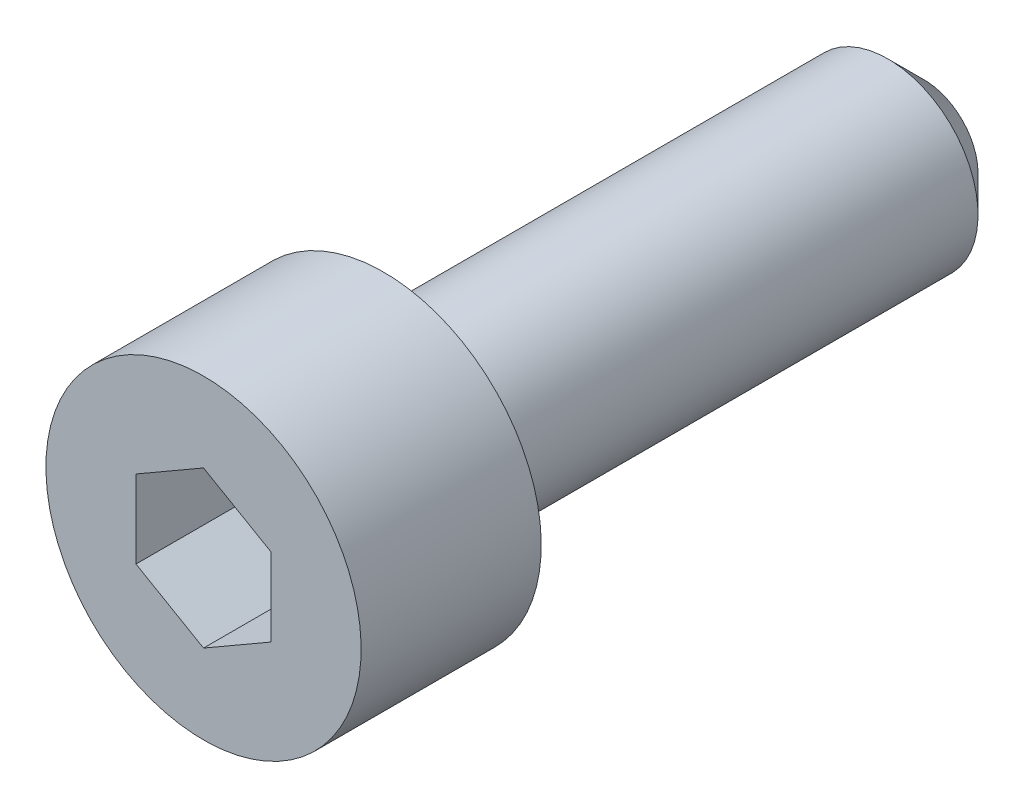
ISO-10303-21;
HEADER;
FILE_DESCRIPTION(('STEP AP214'),'2;1');
FILE_NAME('part.step','',(''),(''),'','','');
FILE_SCHEMA(('AUTOMOTIVE_DESIGN { 1 0 10303 214 1 1 1 1 }'));
ENDSEC;
DATA;
#1=APPLICATION_CONTEXT('core data for automotive mechanical design processes');
#2=APPLICATION_PROTOCOL_DEFINITION('international standard','automotive_design',2000,#1);
#3=PRODUCT_CONTEXT('',#1,'mechanical');
#4=PRODUCT('Part','Part','',(#3));
#5=PRODUCT_RELATED_PRODUCT_CATEGORY('part','',(#4));
#6=PRODUCT_DEFINITION_FORMATION('','',#4);
#7=PRODUCT_DEFINITION_CONTEXT('part definition',#1,'design');
#8=PRODUCT_DEFINITION('design','',#6,#7);
#9=PRODUCT_DEFINITION_SHAPE('','',#8);
#10=(LENGTH_UNIT() NAMED_UNIT(*) SI_UNIT(.MILLI.,.METRE.));
#11=(NAMED_UNIT(*) PLANE_ANGLE_UNIT() SI_UNIT($,.RADIAN.));
#12=(NAMED_UNIT(*) SI_UNIT($,.STERADIAN.) SOLID_ANGLE_UNIT());
#13=UNCERTAINTY_MEASURE_WITH_UNIT(LENGTH_MEASURE(1.E-05),#10,'distance_accuracy_value','');
#14=(GEOMETRIC_REPRESENTATION_CONTEXT(3) GLOBAL_UNCERTAINTY_ASSIGNED_CONTEXT((#13)) GLOBAL_UNIT_ASSIGNED_CONTEXT((#10,
#11,#12)) REPRESENTATION_CONTEXT('',''));
#15=CARTESIAN_POINT('',(0.,0.,0.));
#16=DIRECTION('',(0.,0.,1.));
#17=DIRECTION('',(1.,0.,0.));
#18=AXIS2_PLACEMENT_3D('',#15,#16,#17);
#19=CARTESIAN_POINT('',(0.,0.,0.));
#20=DIRECTION('',(0.,0.,-1.));
#21=DIRECTION('',(-0.866025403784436,0.5,0.));
#22=AXIS2_PLACEMENT_3D('',#19,#20,#21);
#23=CYLINDRICAL_SURFACE('',#22,2.);
#24=CARTESIAN_POINT('',(0.,0.,-11.2));
#25=DIRECTION('',(0.,0.,-1.));
#26=DIRECTION('',(-0.866025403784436,0.5,0.));
#27=AXIS2_PLACEMENT_3D('',#24,#25,#26);
#28=CIRCLE('',#27,2.);
#29=CARTESIAN_POINT('',(-1.73205080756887,1.,-11.2));
#30=VERTEX_POINT('',#29);
#31=EDGE_CURVE('E9',#30,#30,#28,.F.);
#32=ORIENTED_EDGE('',*,*,#31,.T.);
#33=EDGE_LOOP('',(#32));
#34=FACE_BOUND('',#33,.T.);
#35=CARTESIAN_POINT('',(0.,0.,0.));
#36=DIRECTION('',(0.,0.,-1.));
#37=DIRECTION('',(-0.866025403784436,0.5,0.));
#38=AXIS2_PLACEMENT_3D('',#35,#36,#37);
#39=CIRCLE('',#38,2.);
#40=CARTESIAN_POINT('',(-1.73205080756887,1.,0.));
#41=VERTEX_POINT('',#40);
#42=EDGE_CURVE('E129',#41,#41,#39,.T.);
#43=ORIENTED_EDGE('',*,*,#42,.T.);
#44=EDGE_LOOP('',(#43));
#45=FACE_BOUND('',#44,.T.);
#46=ADVANCED_FACE('F14',(#34,#45),#23,.T.);
#47=CARTESIAN_POINT('',(1.75,3.03108891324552,0.));
#48=DIRECTION('',(0.,0.,1.));
#49=DIRECTION('',(0.866025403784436,-0.5,0.));
#50=AXIS2_PLACEMENT_3D('',#47,#48,#49);
#51=PLANE('',#50);
#52=ORIENTED_EDGE('',*,*,#42,.F.);
#53=EDGE_LOOP('',(#52));
#54=FACE_BOUND('',#53,.T.);
#55=CARTESIAN_POINT('',(0.,0.,0.));
#56=DIRECTION('',(0.,0.,-1.));
#57=DIRECTION('',(-0.866025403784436,0.5,0.));
#58=AXIS2_PLACEMENT_3D('',#55,#56,#57);
#59=CIRCLE('',#58,3.5);
#60=CARTESIAN_POINT('',(-3.03108891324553,1.75,0.));
#61=VERTEX_POINT('',#60);
#62=EDGE_CURVE('E126',#61,#61,#59,.T.);
#63=ORIENTED_EDGE('',*,*,#62,.T.);
#64=EDGE_LOOP('',(#63));
#65=FACE_BOUND('',#64,.T.);
#66=ADVANCED_FACE('F148',(#54,#65),#51,.F.);
#67=CARTESIAN_POINT('',(0.,0.,0.));
#68=DIRECTION('',(0.,0.,-1.));
#69=DIRECTION('',(-0.866025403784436,0.5,0.));
#70=AXIS2_PLACEMENT_3D('',#67,#68,#69);
#71=CYLINDRICAL_SURFACE('',#70,3.5);
#72=ORIENTED_EDGE('',*,*,#62,.F.);
#73=EDGE_LOOP('',(#72));
#74=FACE_BOUND('',#73,.T.);
#75=CARTESIAN_POINT('',(0.,0.,4.));
#76=DIRECTION('',(0.,0.,-1.));
#77=DIRECTION('',(-0.866025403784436,0.5,0.));
#78=AXIS2_PLACEMENT_3D('',#75,#76,#77);
#79=CIRCLE('',#78,3.5);
#80=CARTESIAN_POINT('',(-3.03108891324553,1.75,4.));
#81=VERTEX_POINT('',#80);
#82=EDGE_CURVE('E117',#81,#81,#79,.T.);
#83=ORIENTED_EDGE('',*,*,#82,.T.);
#84=EDGE_LOOP('',(#83));
#85=FACE_BOUND('',#84,.T.);
#86=ADVANCED_FACE('F154',(#74,#85),#71,.T.);
#87=CARTESIAN_POINT('',(0.,0.,4.));
#88=DIRECTION('',(0.,0.,-1.));
#89=DIRECTION('',(-0.866025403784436,0.5,0.));
#90=AXIS2_PLACEMENT_3D('',#87,#88,#89);
#91=PLANE('',#90);
#92=DIRECTION('',(0.,1.,0.));
#93=VECTOR('',#92,1.);
#94=CARTESIAN_POINT('',(1.5,0.866025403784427,4.));
#95=LINE('',#94,#93);
#96=CARTESIAN_POINT('',(1.5,-0.866025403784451,4.));
#97=VERTEX_POINT('',#96);
#98=CARTESIAN_POINT('',(1.5,0.866025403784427,4.));
#99=VERTEX_POINT('',#98);
#100=EDGE_CURVE('E83',#97,#99,#95,.T.);
#101=ORIENTED_EDGE('',*,*,#100,.F.);
#102=DIRECTION('',(0.866025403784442,0.5,0.));
#103=VECTOR('',#102,1.);
#104=CARTESIAN_POINT('',(0.,-1.73205080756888,4.));
#105=LINE('',#104,#103);
#106=CARTESIAN_POINT('',(0.,-1.73205080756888,4.));
#107=VERTEX_POINT('',#106);
#108=EDGE_CURVE('E29',#107,#97,#105,.T.);
#109=ORIENTED_EDGE('',*,*,#108,.F.);
#110=DIRECTION('',(0.866025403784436,-0.5,0.));
#111=VECTOR('',#110,1.);
#112=CARTESIAN_POINT('',(-1.5,-0.866025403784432,4.));
#113=LINE('',#112,#111);
#114=CARTESIAN_POINT('',(-1.5,-0.866025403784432,4.));
#115=VERTEX_POINT('',#114);
#116=EDGE_CURVE('E99',#115,#107,#113,.T.);
#117=ORIENTED_EDGE('',*,*,#116,.F.);
#118=DIRECTION('',(0.,-1.,0.));
#119=VECTOR('',#118,1.);
#120=CARTESIAN_POINT('',(-1.5,-0.866025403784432,4.));
#121=LINE('',#120,#119);
#122=CARTESIAN_POINT('',(-1.5,0.86602540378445,4.));
#123=VERTEX_POINT('',#122);
#124=EDGE_CURVE('E93',#123,#115,#121,.T.);
#125=ORIENTED_EDGE('',*,*,#124,.F.);
#126=DIRECTION('',(-0.86602540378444,-0.499999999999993,0.));
#127=VECTOR('',#126,1.);
#128=CARTESIAN_POINT('',(0.,1.73205080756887,4.));
#129=LINE('',#128,#127);
#130=CARTESIAN_POINT('',(0.,1.73205080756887,4.));
#131=VERTEX_POINT('',#130);
#132=EDGE_CURVE('E91',#131,#123,#129,.T.);
#133=ORIENTED_EDGE('',*,*,#132,.F.);
#134=DIRECTION('',(-0.866025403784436,0.5,0.));
#135=VECTOR('',#134,1.);
#136=CARTESIAN_POINT('',(0.,1.73205080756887,4.));
#137=LINE('',#136,#135);
#138=EDGE_CURVE('E72',#99,#131,#137,.T.);
#139=ORIENTED_EDGE('',*,*,#138,.F.);
#140=EDGE_LOOP('',(#101,#109,#117,#125,#133,#139));
#141=FACE_BOUND('',#140,.T.);
#142=ORIENTED_EDGE('',*,*,#82,.F.);
#143=EDGE_LOOP('',(#142));
#144=FACE_BOUND('',#143,.T.);
#145=ADVANCED_FACE('F87',(#141,#144),#91,.F.);
#146=CARTESIAN_POINT('',(0.,0.,-12.));
#147=DIRECTION('',(0.,0.,-1.));
#148=DIRECTION('',(-0.866025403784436,0.5,0.));
#149=AXIS2_PLACEMENT_3D('',#146,#147,#148);
#150=PLANE('',#149);
#151=CARTESIAN_POINT('',(0.,0.,-12.));
#152=DIRECTION('',(0.,0.,-1.));
#153=DIRECTION('',(-0.866025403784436,0.5,0.));
#154=AXIS2_PLACEMENT_3D('',#151,#152,#153);
#155=CIRCLE('',#154,1.2);
#156=CARTESIAN_POINT('',(-1.03923048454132,0.6,-12.));
#157=VERTEX_POINT('',#156);
#158=EDGE_CURVE('E22',#157,#157,#155,.T.);
#159=ORIENTED_EDGE('',*,*,#158,.T.);
#160=EDGE_LOOP('',(#159));
#161=FACE_BOUND('',#160,.T.);
#162=ADVANCED_FACE('F134',(#161),#150,.T.);
#163=CARTESIAN_POINT('',(0.,-1.73205080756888,1.8));
#164=DIRECTION('',(0.5,-0.866025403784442,0.));
#165=DIRECTION('',(0.866025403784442,0.5,0.));
#166=AXIS2_PLACEMENT_3D('',#163,#164,#165);
#167=PLANE('',#166);
#168=ORIENTED_EDGE('',*,*,#108,.T.);
#169=DIRECTION('',(0.,0.,1.));
#170=VECTOR('',#169,1.);
#171=CARTESIAN_POINT('',(1.5,-0.86602540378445,1.8));
#172=LINE('',#171,#170);
#173=CARTESIAN_POINT('',(1.5,-0.86602540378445,1.8));
#174=VERTEX_POINT('',#173);
#175=EDGE_CURVE('E80',#174,#97,#172,.T.);
#176=ORIENTED_EDGE('',*,*,#175,.F.);
#177=DIRECTION('',(0.866025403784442,0.5,0.));
#178=VECTOR('',#177,1.);
#179=CARTESIAN_POINT('',(0.,-1.73205080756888,1.8));
#180=LINE('',#179,#178);
#181=CARTESIAN_POINT('',(0.,-1.73205080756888,1.8));
#182=VERTEX_POINT('',#181);
#183=EDGE_CURVE('E101',#182,#174,#180,.T.);
#184=ORIENTED_EDGE('',*,*,#183,.F.);
#185=DIRECTION('',(0.,0.,1.));
#186=VECTOR('',#185,1.);
#187=CARTESIAN_POINT('',(0.,-1.73205080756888,1.8));
#188=LINE('',#187,#186);
#189=EDGE_CURVE('E36',#182,#107,#188,.T.);
#190=ORIENTED_EDGE('',*,*,#189,.T.);
#191=EDGE_LOOP('',(#168,#176,#184,#190));
#192=FACE_BOUND('',#191,.T.);
#193=ADVANCED_FACE('F166',(#192),#167,.F.);
#194=CARTESIAN_POINT('',(-1.5,-0.866025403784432,1.8));
#195=DIRECTION('',(-0.5,-0.866025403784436,0.));
#196=DIRECTION('',(0.,0.,-1.));
#197=AXIS2_PLACEMENT_3D('',#194,#195,#196);
#198=PLANE('',#197);
#199=ORIENTED_EDGE('',*,*,#116,.T.);
#200=ORIENTED_EDGE('',*,*,#189,.F.);
#201=DIRECTION('',(0.866025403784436,-0.5,0.));
#202=VECTOR('',#201,1.);
#203=CARTESIAN_POINT('',(-1.5,-0.866025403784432,1.8));
#204=LINE('',#203,#202);
#205=CARTESIAN_POINT('',(-1.5,-0.866025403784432,1.8));
#206=VERTEX_POINT('',#205);
#207=EDGE_CURVE('E113',#206,#182,#204,.T.);
#208=ORIENTED_EDGE('',*,*,#207,.F.);
#209=DIRECTION('',(0.,0.,1.));
#210=VECTOR('',#209,1.);
#211=CARTESIAN_POINT('',(-1.5,-0.866025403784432,1.8));
#212=LINE('',#211,#210);
#213=EDGE_CURVE('E118',#206,#115,#212,.T.);
#214=ORIENTED_EDGE('',*,*,#213,.T.);
#215=EDGE_LOOP('',(#199,#200,#208,#214));
#216=FACE_BOUND('',#215,.T.);
#217=ADVANCED_FACE('F169',(#216),#198,.F.);
#218=CARTESIAN_POINT('',(-1.5,-0.866025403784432,1.8));
#219=DIRECTION('',(-1.,0.,0.));
#220=DIRECTION('',(0.,-1.,0.));
#221=AXIS2_PLACEMENT_3D('',#218,#219,#220);
#222=PLANE('',#221);
#223=ORIENTED_EDGE('',*,*,#124,.T.);
#224=ORIENTED_EDGE('',*,*,#213,.F.);
#225=DIRECTION('',(0.,-1.,0.));
#226=VECTOR('',#225,1.);
#227=CARTESIAN_POINT('',(-1.5,-0.866025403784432,1.8));
#228=LINE('',#227,#226);
#229=CARTESIAN_POINT('',(-1.5,0.86602540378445,1.8));
#230=VERTEX_POINT('',#229);
#231=EDGE_CURVE('E110',#230,#206,#228,.T.);
#232=ORIENTED_EDGE('',*,*,#231,.F.);
#233=DIRECTION('',(0.,0.,1.));
#234=VECTOR('',#233,1.);
#235=CARTESIAN_POINT('',(-1.5,0.86602540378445,1.8));
#236=LINE('',#235,#234);
#237=EDGE_CURVE('E120',#230,#123,#236,.T.);
#238=ORIENTED_EDGE('',*,*,#237,.T.);
#239=EDGE_LOOP('',(#223,#224,#232,#238));
#240=FACE_BOUND('',#239,.T.);
#241=ADVANCED_FACE('F177',(#240),#222,.F.);
#242=CARTESIAN_POINT('',(0.,1.73205080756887,1.8));
#243=DIRECTION('',(-0.499999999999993,0.86602540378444,0.));
#244=DIRECTION('',(-0.86602540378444,-0.499999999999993,0.));
#245=AXIS2_PLACEMENT_3D('',#242,#243,#244);
#246=PLANE('',#245);
#247=ORIENTED_EDGE('',*,*,#132,.T.);
#248=ORIENTED_EDGE('',*,*,#237,.F.);
#249=DIRECTION('',(-0.86602540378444,-0.499999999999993,0.));
#250=VECTOR('',#249,1.);
#251=CARTESIAN_POINT('',(0.,1.73205080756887,1.8));
#252=LINE('',#251,#250);
#253=CARTESIAN_POINT('',(0.,1.73205080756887,1.8));
#254=VERTEX_POINT('',#253);
#255=EDGE_CURVE('E107',#254,#230,#252,.T.);
#256=ORIENTED_EDGE('',*,*,#255,.F.);
#257=DIRECTION('',(0.,0.,1.));
#258=VECTOR('',#257,1.);
#259=CARTESIAN_POINT('',(0.,1.73205080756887,1.8));
#260=LINE('',#259,#258);
#261=EDGE_CURVE('E79',#254,#131,#260,.T.);
#262=ORIENTED_EDGE('',*,*,#261,.T.);
#263=EDGE_LOOP('',(#247,#248,#256,#262));
#264=FACE_BOUND('',#263,.T.);
#265=ADVANCED_FACE('F174',(#264),#246,.F.);
#266=CARTESIAN_POINT('',(0.,1.73205080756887,1.8));
#267=DIRECTION('',(0.5,0.866025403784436,0.));
#268=DIRECTION('',(0.,0.,1.));
#269=AXIS2_PLACEMENT_3D('',#266,#267,#268);
#270=PLANE('',#269);
#271=ORIENTED_EDGE('',*,*,#138,.T.);
#272=ORIENTED_EDGE('',*,*,#261,.F.);
#273=DIRECTION('',(-0.866025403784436,0.5,0.));
#274=VECTOR('',#273,1.);
#275=CARTESIAN_POINT('',(0.,1.73205080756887,1.8));
#276=LINE('',#275,#274);
#277=CARTESIAN_POINT('',(1.5,0.866025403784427,1.8));
#278=VERTEX_POINT('',#277);
#279=EDGE_CURVE('E75',#278,#254,#276,.T.);
#280=ORIENTED_EDGE('',*,*,#279,.F.);
#281=DIRECTION('',(0.,0.,1.));
#282=VECTOR('',#281,1.);
#283=CARTESIAN_POINT('',(1.5,0.866025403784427,1.8));
#284=LINE('',#283,#282);
#285=EDGE_CURVE('E68',#278,#99,#284,.T.);
#286=ORIENTED_EDGE('',*,*,#285,.T.);
#287=EDGE_LOOP('',(#271,#272,#280,#286));
#288=FACE_BOUND('',#287,.T.);
#289=ADVANCED_FACE('F70',(#288),#270,.F.);
#290=CARTESIAN_POINT('',(1.5,0.866025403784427,1.8));
#291=DIRECTION('',(1.,0.,0.));
#292=DIRECTION('',(0.,1.,0.));
#293=AXIS2_PLACEMENT_3D('',#290,#291,#292);
#294=PLANE('',#293);
#295=ORIENTED_EDGE('',*,*,#100,.T.);
#296=ORIENTED_EDGE('',*,*,#285,.F.);
#297=DIRECTION('',(0.,1.,0.));
#298=VECTOR('',#297,1.);
#299=CARTESIAN_POINT('',(1.5,0.866025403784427,1.8));
#300=LINE('',#299,#298);
#301=EDGE_CURVE('E104',#174,#278,#300,.T.);
#302=ORIENTED_EDGE('',*,*,#301,.F.);
#303=ORIENTED_EDGE('',*,*,#175,.T.);
#304=EDGE_LOOP('',(#295,#296,#302,#303));
#305=FACE_BOUND('',#304,.T.);
#306=ADVANCED_FACE('F84',(#305),#294,.F.);
#307=CARTESIAN_POINT('',(3.,0.,1.8));
#308=DIRECTION('',(0.,0.,-1.));
#309=DIRECTION('',(-0.866025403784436,0.5,0.));
#310=AXIS2_PLACEMENT_3D('',#307,#308,#309);
#311=PLANE('',#310);
#312=ORIENTED_EDGE('',*,*,#183,.T.);
#313=ORIENTED_EDGE('',*,*,#301,.T.);
#314=ORIENTED_EDGE('',*,*,#279,.T.);
#315=ORIENTED_EDGE('',*,*,#255,.T.);
#316=ORIENTED_EDGE('',*,*,#231,.T.);
#317=ORIENTED_EDGE('',*,*,#207,.T.);
#318=EDGE_LOOP('',(#312,#313,#314,#315,#316,#317));
#319=FACE_BOUND('',#318,.T.);
#320=ADVANCED_FACE('F137',(#319),#311,.F.);
#321=CARTESIAN_POINT('',(0.,0.,-12.));
#322=DIRECTION('',(0.,0.,1.));
#323=DIRECTION('',(0.866025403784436,-0.5,0.));
#324=AXIS2_PLACEMENT_3D('',#321,#322,#323);
#325=CONICAL_SURFACE('',#324,1.2,0.785398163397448);
#326=ORIENTED_EDGE('',*,*,#31,.F.);
#327=EDGE_LOOP('',(#326));
#328=FACE_BOUND('',#327,.T.);
#329=ORIENTED_EDGE('',*,*,#158,.F.);
#330=EDGE_LOOP('',(#329));
#331=FACE_BOUND('',#330,.T.);
#332=ADVANCED_FACE('F16',(#328,#331),#325,.T.);
#333=CLOSED_SHELL('',(#46,#66,#86,#145,#162,#193,#217,#241,#265,#289,#306,#320,#332));
#334=MANIFOLD_SOLID_BREP('B1',#333);
#335=ADVANCED_BREP_SHAPE_REPRESENTATION('',(#18,#334),#14);
#336=SHAPE_DEFINITION_REPRESENTATION(#9,#335);
ENDSEC;
END-ISO-10303-21;
